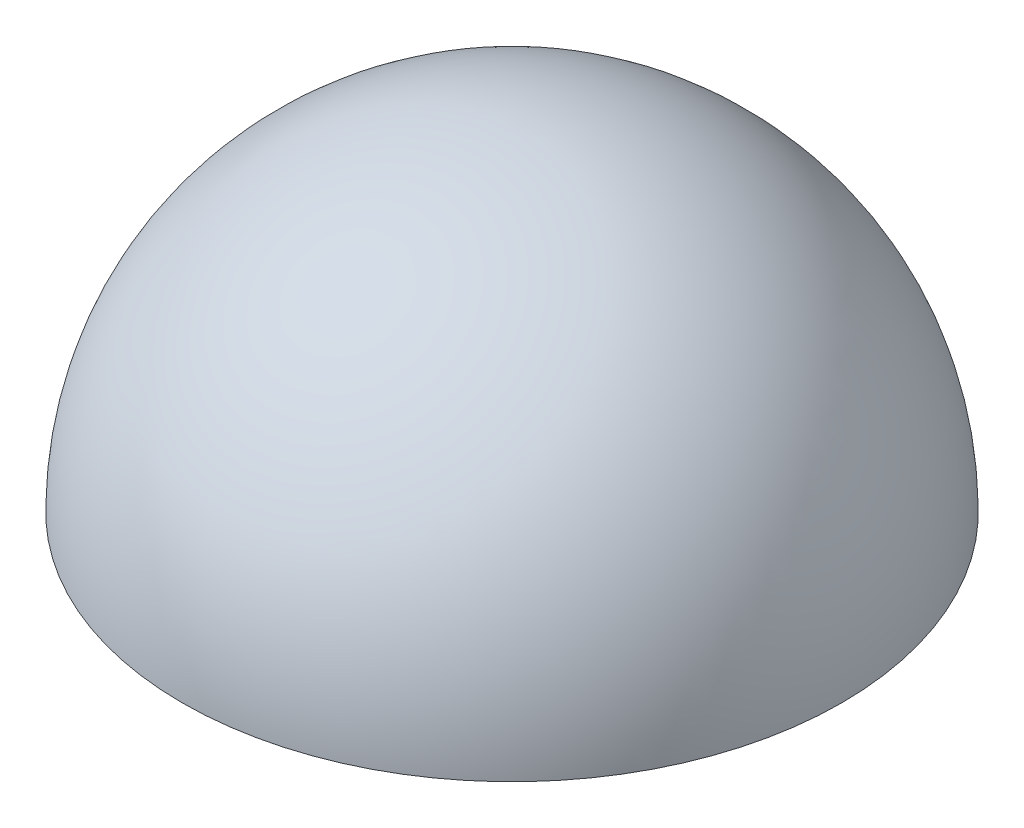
ISO-10303-21;
HEADER;
FILE_DESCRIPTION(('STEP AP214'),'2;1');
FILE_NAME('part.step','',(''),(''),'','','');
FILE_SCHEMA(('AUTOMOTIVE_DESIGN { 1 0 10303 214 1 1 1 1 }'));
ENDSEC;
DATA;
#1=APPLICATION_CONTEXT('core data for automotive mechanical design processes');
#2=APPLICATION_PROTOCOL_DEFINITION('international standard','automotive_design',2000,#1);
#3=PRODUCT_CONTEXT('',#1,'mechanical');
#4=PRODUCT('Part','Part','',(#3));
#5=PRODUCT_RELATED_PRODUCT_CATEGORY('part','',(#4));
#6=PRODUCT_DEFINITION_FORMATION('','',#4);
#7=PRODUCT_DEFINITION_CONTEXT('part definition',#1,'design');
#8=PRODUCT_DEFINITION('design','',#6,#7);
#9=PRODUCT_DEFINITION_SHAPE('','',#8);
#10=(LENGTH_UNIT() NAMED_UNIT(*) SI_UNIT(.MILLI.,.METRE.));
#11=(NAMED_UNIT(*) PLANE_ANGLE_UNIT() SI_UNIT($,.RADIAN.));
#12=(NAMED_UNIT(*) SI_UNIT($,.STERADIAN.) SOLID_ANGLE_UNIT());
#13=UNCERTAINTY_MEASURE_WITH_UNIT(LENGTH_MEASURE(1.E-05),#10,'distance_accuracy_value','');
#14=(GEOMETRIC_REPRESENTATION_CONTEXT(3) GLOBAL_UNCERTAINTY_ASSIGNED_CONTEXT((#13)) GLOBAL_UNIT_ASSIGNED_CONTEXT((#10,
#11,#12)) REPRESENTATION_CONTEXT('',''));
#15=CARTESIAN_POINT('',(0.,0.,0.));
#16=DIRECTION('',(0.,0.,1.));
#17=DIRECTION('',(1.,0.,0.));
#18=AXIS2_PLACEMENT_3D('',#15,#16,#17);
#19=CARTESIAN_POINT('',(0.,0.,0.));
#20=DIRECTION('',(0.,1.,0.));
#21=DIRECTION('',(-1.,0.,0.));
#22=AXIS2_PLACEMENT_3D('',#19,#20,#21);
#23=PLANE('',#22);
#24=CARTESIAN_POINT('',(0.,0.,0.));
#25=DIRECTION('',(0.,1.,0.));
#26=DIRECTION('',(-1.,0.,0.));
#27=AXIS2_PLACEMENT_3D('',#24,#25,#26);
#28=CIRCLE('',#27,44.45);
#29=CARTESIAN_POINT('',(-44.45,0.,0.));
#30=VERTEX_POINT('',#29);
#31=EDGE_CURVE('E10',#30,#30,#28,.T.);
#32=ORIENTED_EDGE('',*,*,#31,.F.);
#33=EDGE_LOOP('',(#32));
#34=FACE_BOUND('',#33,.T.);
#35=ADVANCED_FACE('F31',(#34),#23,.F.);
#36=CARTESIAN_POINT('',(0.,0.,0.));
#37=DIRECTION('',(0.,1.,0.));
#38=DIRECTION('',(1.,0.,0.));
#39=AXIS2_PLACEMENT_3D('',#36,#37,#38);
#40=SPHERICAL_SURFACE('',#39,44.45);
#41=ORIENTED_EDGE('',*,*,#31,.T.);
#42=EDGE_LOOP('',(#41));
#43=FACE_BOUND('',#42,.T.);
#44=ADVANCED_FACE('F38',(#43),#40,.T.);
#45=CLOSED_SHELL('',(#35,#44));
#46=MANIFOLD_SOLID_BREP('B2',#45);
#47=ADVANCED_BREP_SHAPE_REPRESENTATION('',(#18,#46),#14);
#48=SHAPE_DEFINITION_REPRESENTATION(#9,#47);
ENDSEC;
END-ISO-10303-21;
